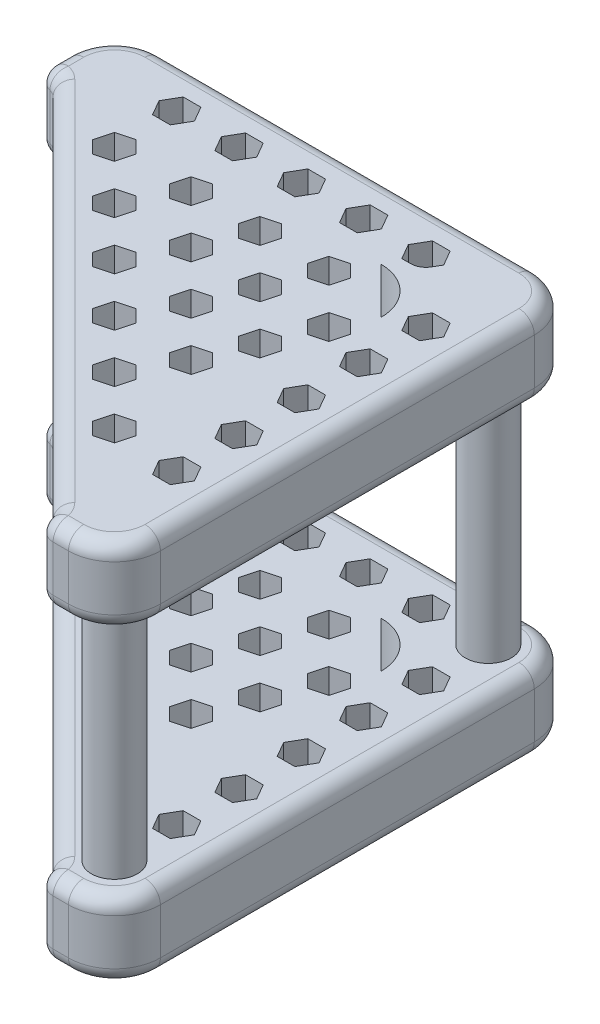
from build123d import *

# Parameters (mm, degrees)
SKETCH1_R           = 1.5
BOSS_EXTRUDE1_DEPTH = 5
SKETCH1_2_R         = 1.5
BOSS_EXTRUDE2_DEPTH = 25
BOSS_EXTRUDE3_START = -5
SKETCH2_R           = 1.5
BOSS_EXTRUDE3_DEPTH = 5
FILLET1_R           = 1


with BuildPart() as part:
    # Sketch1 → Boss-Extrude1 (new body)
    with BuildSketch(Plane(origin=(0, 0, 0), x_dir=(1, 0, 0), z_dir=(0, 1, 0))):
        with BuildLine():
            Line((-9.7, 17.7), (14.7, 17.7))
            ThreePointArc((14.7, 17.7), (16.821320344, 16.821320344), (17.7, 14.7))
            Line((17.7, 14.7), (17.7, -9.7))
            ThreePointArc((17.7, -9.7), (16.821320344, -11.821320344), (14.7, -12.7))
            Line((14.7, -12.7), (13.7, -12.7))
            ThreePointArc((13.7, -12.7), (13.08159356, -12.485858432), (12.72804017, -11.935146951))
            ThreePointArc((12.72804017, -11.935146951), (12.628148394, -11.68090928), (12.463187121, -11.463187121))
            Line((12.463187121, -11.463187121), (-11.463187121, 12.463187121))
            ThreePointArc((-11.463187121, 12.463187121), (-11.68090928, 12.628148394), (-11.935146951, 12.72804017))
            ThreePointArc((-11.935146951, 12.72804017), (-12.485858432, 13.08159356), (-12.7, 13.7))
            Line((-12.7, 13.7), (-12.7, 14.7))
            ThreePointArc((-12.7, 14.7), (-11.821320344, 16.821320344), (-9.7, 17.7))
        make_face()
        with Locations(Location((-9.7, 14.7, 0), (0, 0, 270))):
            Circle(SKETCH1_R, mode=Mode.SUBTRACT)
        with Locations(Location((14.7, -9.7, 0), (0, 0, 270))):
            Circle(SKETCH1_R, mode=Mode.SUBTRACT)
        with Locations(Location((14.7, 14.7, 0), (0, 0, 270))):
            Circle(SKETCH1_R, mode=Mode.SUBTRACT)
        Polygon((-4.478632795, 14.7), (-5.055983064, 15.7), (-6.210683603, 15.7), (-6.788033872, 14.7), (-6.210683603, 13.7), (-5.055983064, 13.7), align=None, mode=Mode.SUBTRACT)
        Polygon((-0.411966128, 14.7), (-0.989316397, 15.7), (-2.144016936, 15.7), (-2.721367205, 14.7), (-2.144016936, 13.7), (-0.989316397, 13.7), align=None, mode=Mode.SUBTRACT)
        Polygon((3.654700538, 14.7), (3.077350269, 15.7), (1.922649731, 15.7), (1.345299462, 14.7), (1.922649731, 13.7), (3.077350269, 13.7), align=None, mode=Mode.SUBTRACT)
        Polygon((7.721367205, 14.7), (7.144016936, 15.7), (5.989316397, 15.7), (5.411966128, 14.7), (5.989316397, 13.7), (7.144016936, 13.7), align=None, mode=Mode.SUBTRACT)
        Polygon((11.788033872, 14.7), (11.210683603, 15.7), (10.055983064, 15.7), (9.478632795, 14.7), (10.055983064, 13.7), (11.210683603, 13.7), align=None, mode=Mode.SUBTRACT)
        Polygon((15.854700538, 10.633333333), (15.277350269, 11.633333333), (14.122649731, 11.633333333), (13.545299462, 10.633333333), (14.122649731, 9.633333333), (15.277350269, 9.633333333), align=None, mode=Mode.SUBTRACT)
        Polygon((15.854700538, 6.566666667), (15.277350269, 7.566666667), (14.122649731, 7.566666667), (13.545299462, 6.566666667), (14.122649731, 5.566666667), (15.277350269, 5.566666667), align=None, mode=Mode.SUBTRACT)
        Polygon((15.854700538, 2.5), (15.277350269, 3.5), (14.122649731, 3.5), (13.545299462, 2.5), (14.122649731, 1.5), (15.277350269, 1.5), align=None, mode=Mode.SUBTRACT)
        Polygon((15.854700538, -1.566666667), (15.277350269, -0.566666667), (14.122649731, -0.566666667), (13.545299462, -1.566666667), (14.122649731, -2.566666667), (15.277350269, -2.566666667), align=None, mode=Mode.SUBTRACT)
        Polygon((15.854700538, -5.633333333), (15.277350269, -4.633333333), (14.122649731, -4.633333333), (13.545299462, -5.633333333), (14.122649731, -6.633333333), (15.277350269, -6.633333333), align=None, mode=Mode.SUBTRACT)
        with BuildLine():
            Line((9.7, 12.7), (12.7, 9.7))
            ThreePointArc((12.7, 9.7), (11.821320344, 11.821320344), (9.7, 12.7))
        make_face(mode=Mode.SUBTRACT)
        Polygon((-1.634856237, 6.634856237), (-1.335997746, 7.750211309), (-2.152494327, 8.56670789), (-3.267849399, 8.267849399), (-3.56670789, 7.152494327), (-2.750211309, 6.335997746), align=None, mode=Mode.SUBTRACT)
        Polygon((-4.816836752, 9.816836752), (-4.517978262, 10.932191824), (-5.334474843, 11.748688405), (-6.449829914, 11.449829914), (-6.748688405, 10.334474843), (-5.932191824, 9.517978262), align=None, mode=Mode.SUBTRACT)
        Polygon((1.547124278, 3.452875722), (1.845982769, 4.568230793), (1.029486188, 5.384727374), (-0.085868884, 5.085868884), (-0.384727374, 3.970513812), (0.431769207, 3.154017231), align=None, mode=Mode.SUBTRACT)
        Polygon((4.729104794, 0.270895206), (5.027963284, 1.386250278), (4.211466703, 2.202746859), (3.096111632, 1.903888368), (2.797253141, 0.788533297), (3.613749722, -0.027963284), align=None, mode=Mode.SUBTRACT)
        Polygon((7.911085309, -2.911085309), (8.2099438, -1.795730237), (7.393447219, -0.979233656), (6.278092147, -1.278092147), (5.979233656, -2.393447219), (6.795730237, -3.2099438), align=None, mode=Mode.SUBTRACT)
        Polygon((11.093065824, -6.093065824), (11.391924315, -4.977710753), (10.575427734, -4.161214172), (9.460072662, -4.460072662), (9.161214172, -5.575427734), (9.977710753, -6.391924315), align=None, mode=Mode.SUBTRACT)
        Polygon((0.183163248, 9.816836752), (0.482021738, 10.932191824), (-0.334474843, 11.748688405), (-1.449829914, 11.449829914), (-1.748688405, 10.334474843), (-0.932191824, 9.517978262), align=None, mode=Mode.SUBTRACT)
        Polygon((3.365143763, 6.634856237), (3.664002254, 7.750211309), (2.847505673, 8.56670789), (1.732150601, 8.267849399), (1.43329211, 7.152494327), (2.249788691, 6.335997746), align=None, mode=Mode.SUBTRACT)
        Polygon((6.547124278, 3.452875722), (6.845982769, 4.568230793), (6.029486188, 5.384727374), (4.914131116, 5.085868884), (4.615272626, 3.970513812), (5.431769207, 3.154017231), align=None, mode=Mode.SUBTRACT)
        Polygon((9.729104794, 0.270895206), (10.027963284, 1.386250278), (9.211466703, 2.202746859), (8.096111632, 1.903888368), (7.797253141, 0.788533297), (8.613749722, -0.027963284), align=None, mode=Mode.SUBTRACT)
        Polygon((4.683163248, 9.816836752), (4.982021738, 10.932191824), (4.165525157, 11.748688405), (3.050170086, 11.449829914), (2.751311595, 10.334474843), (3.567808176, 9.517978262), align=None, mode=Mode.SUBTRACT)
        Polygon((7.865143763, 6.634856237), (8.164002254, 7.750211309), (7.347505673, 8.56670789), (6.232150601, 8.267849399), (5.93329211, 7.152494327), (6.749788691, 6.335997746), align=None, mode=Mode.SUBTRACT)
        Polygon((11.047124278, 3.452875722), (11.345982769, 4.568230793), (10.529486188, 5.384727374), (9.414131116, 5.085868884), (9.115272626, 3.970513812), (9.931769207, 3.154017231), align=None, mode=Mode.SUBTRACT)
        Polygon((9.183163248, 9.816836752), (9.482021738, 10.932191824), (8.665525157, 11.748688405), (7.550170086, 11.449829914), (7.251311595, 10.334474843), (8.067808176, 9.517978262), align=None, mode=Mode.SUBTRACT)
        Polygon((12.365143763, 6.634856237), (12.664002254, 7.750211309), (11.847505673, 8.56670789), (10.732150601, 8.267849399), (10.43329211, 7.152494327), (11.249788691, 6.335997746), align=None, mode=Mode.SUBTRACT)
    extrude(amount=BOSS_EXTRUDE1_DEPTH)

    # Sketch1_2 → Boss-Extrude2 (add)
    with BuildSketch(Plane(origin=(0, 0, 0), x_dir=(1, 0, 0), z_dir=(0, 1, 0))):
        with Locations(Location((14.7, 14.7, 0), (0, 0, 270))):
            Circle(SKETCH1_2_R)
        with Locations(Location((-9.7, 14.7, 0), (0, 0, 270))):
            Circle(SKETCH1_2_R)
        with Locations(Location((14.7, -9.7, 0), (0, 0, 270))):
            Circle(SKETCH1_2_R)
    extrude(amount=BOSS_EXTRUDE2_DEPTH)

    # Sketch2 → Boss-Extrude3 (add)
    with BuildSketch(Plane(origin=(0, 25, 0), x_dir=(1, 0, 0), z_dir=(0, 1, 0)).offset(BOSS_EXTRUDE3_START)):
        with BuildLine():
            Line((-9.7, 17.7), (14.7, 17.7))
            ThreePointArc((14.7, 17.7), (16.821320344, 16.821320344), (17.7, 14.7))
            Line((17.7, 14.7), (17.7, -9.7))
            ThreePointArc((17.7, -9.7), (16.821320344, -11.821320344), (14.7, -12.7))
            Line((14.7, -12.7), (13.7, -12.7))
            ThreePointArc((13.7, -12.7), (13.08159356, -12.485858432), (12.72804017, -11.935146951))
            ThreePointArc((12.72804017, -11.935146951), (12.628148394, -11.68090928), (12.463187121, -11.463187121))
            Line((12.463187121, -11.463187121), (-11.463187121, 12.463187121))
            ThreePointArc((-11.463187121, 12.463187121), (-11.68090928, 12.628148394), (-11.935146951, 12.72804017))
            ThreePointArc((-11.935146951, 12.72804017), (-12.485858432, 13.08159356), (-12.7, 13.7))
            Line((-12.7, 13.7), (-12.7, 14.7))
            ThreePointArc((-12.7, 14.7), (-11.821320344, 16.821320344), (-9.7, 17.7))
        make_face()
        with Locations(Location((-9.7, 14.7, 0), (0, 0, 270))):
            Circle(SKETCH2_R, mode=Mode.SUBTRACT)
        with Locations(Location((14.7, -9.7, 0), (0, 0, 270))):
            Circle(SKETCH2_R, mode=Mode.SUBTRACT)
        with Locations(Location((14.7, 14.7, 0), (0, 0, 270))):
            Circle(SKETCH2_R, mode=Mode.SUBTRACT)
        Polygon((-4.478632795, 14.7), (-5.055983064, 15.7), (-6.210683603, 15.7), (-6.788033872, 14.7), (-6.210683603, 13.7), (-5.055983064, 13.7), align=None, mode=Mode.SUBTRACT)
        Polygon((-0.411966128, 14.7), (-0.989316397, 15.7), (-2.144016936, 15.7), (-2.721367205, 14.7), (-2.144016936, 13.7), (-0.989316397, 13.7), align=None, mode=Mode.SUBTRACT)
        Polygon((3.654700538, 14.7), (3.077350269, 15.7), (1.922649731, 15.7), (1.345299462, 14.7), (1.922649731, 13.7), (3.077350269, 13.7), align=None, mode=Mode.SUBTRACT)
        Polygon((7.721367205, 14.7), (7.144016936, 15.7), (5.989316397, 15.7), (5.411966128, 14.7), (5.989316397, 13.7), (7.144016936, 13.7), align=None, mode=Mode.SUBTRACT)
        Polygon((11.788033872, 14.7), (11.210683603, 15.7), (10.055983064, 15.7), (9.478632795, 14.7), (10.055983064, 13.7), (11.210683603, 13.7), align=None, mode=Mode.SUBTRACT)
        Polygon((15.854700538, 10.633333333), (15.277350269, 11.633333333), (14.122649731, 11.633333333), (13.545299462, 10.633333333), (14.122649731, 9.633333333), (15.277350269, 9.633333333), align=None, mode=Mode.SUBTRACT)
        Polygon((15.854700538, 6.566666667), (15.277350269, 7.566666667), (14.122649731, 7.566666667), (13.545299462, 6.566666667), (14.122649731, 5.566666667), (15.277350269, 5.566666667), align=None, mode=Mode.SUBTRACT)
        Polygon((15.854700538, 2.5), (15.277350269, 3.5), (14.122649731, 3.5), (13.545299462, 2.5), (14.122649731, 1.5), (15.277350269, 1.5), align=None, mode=Mode.SUBTRACT)
        Polygon((15.854700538, -1.566666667), (15.277350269, -0.566666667), (14.122649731, -0.566666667), (13.545299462, -1.566666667), (14.122649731, -2.566666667), (15.277350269, -2.566666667), align=None, mode=Mode.SUBTRACT)
        Polygon((15.854700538, -5.633333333), (15.277350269, -4.633333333), (14.122649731, -4.633333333), (13.545299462, -5.633333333), (14.122649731, -6.633333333), (15.277350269, -6.633333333), align=None, mode=Mode.SUBTRACT)
        with BuildLine():
            Line((9.7, 12.7), (12.7, 9.7))
            ThreePointArc((12.7, 9.7), (11.821320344, 11.821320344), (9.7, 12.7))
        make_face(mode=Mode.SUBTRACT)
        Polygon((-1.634856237, 6.634856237), (-1.335997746, 7.750211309), (-2.152494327, 8.56670789), (-3.267849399, 8.267849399), (-3.56670789, 7.152494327), (-2.750211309, 6.335997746), align=None, mode=Mode.SUBTRACT)
        Polygon((-4.816836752, 9.816836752), (-4.517978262, 10.932191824), (-5.334474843, 11.748688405), (-6.449829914, 11.449829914), (-6.748688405, 10.334474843), (-5.932191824, 9.517978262), align=None, mode=Mode.SUBTRACT)
        Polygon((1.547124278, 3.452875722), (1.845982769, 4.568230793), (1.029486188, 5.384727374), (-0.085868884, 5.085868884), (-0.384727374, 3.970513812), (0.431769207, 3.154017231), align=None, mode=Mode.SUBTRACT)
        Polygon((4.729104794, 0.270895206), (5.027963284, 1.386250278), (4.211466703, 2.202746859), (3.096111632, 1.903888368), (2.797253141, 0.788533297), (3.613749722, -0.027963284), align=None, mode=Mode.SUBTRACT)
        Polygon((7.911085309, -2.911085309), (8.2099438, -1.795730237), (7.393447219, -0.979233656), (6.278092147, -1.278092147), (5.979233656, -2.393447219), (6.795730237, -3.2099438), align=None, mode=Mode.SUBTRACT)
        Polygon((11.093065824, -6.093065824), (11.391924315, -4.977710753), (10.575427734, -4.161214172), (9.460072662, -4.460072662), (9.161214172, -5.575427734), (9.977710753, -6.391924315), align=None, mode=Mode.SUBTRACT)
        Polygon((0.183163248, 9.816836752), (0.482021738, 10.932191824), (-0.334474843, 11.748688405), (-1.449829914, 11.449829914), (-1.748688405, 10.334474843), (-0.932191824, 9.517978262), align=None, mode=Mode.SUBTRACT)
        Polygon((3.365143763, 6.634856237), (3.664002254, 7.750211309), (2.847505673, 8.56670789), (1.732150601, 8.267849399), (1.43329211, 7.152494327), (2.249788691, 6.335997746), align=None, mode=Mode.SUBTRACT)
        Polygon((6.547124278, 3.452875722), (6.845982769, 4.568230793), (6.029486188, 5.384727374), (4.914131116, 5.085868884), (4.615272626, 3.970513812), (5.431769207, 3.154017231), align=None, mode=Mode.SUBTRACT)
        Polygon((9.729104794, 0.270895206), (10.027963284, 1.386250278), (9.211466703, 2.202746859), (8.096111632, 1.903888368), (7.797253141, 0.788533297), (8.613749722, -0.027963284), align=None, mode=Mode.SUBTRACT)
        Polygon((4.683163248, 9.816836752), (4.982021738, 10.932191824), (4.165525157, 11.748688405), (3.050170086, 11.449829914), (2.751311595, 10.334474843), (3.567808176, 9.517978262), align=None, mode=Mode.SUBTRACT)
        Polygon((7.865143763, 6.634856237), (8.164002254, 7.750211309), (7.347505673, 8.56670789), (6.232150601, 8.267849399), (5.93329211, 7.152494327), (6.749788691, 6.335997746), align=None, mode=Mode.SUBTRACT)
        Polygon((11.047124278, 3.452875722), (11.345982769, 4.568230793), (10.529486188, 5.384727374), (9.414131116, 5.085868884), (9.115272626, 3.970513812), (9.931769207, 3.154017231), align=None, mode=Mode.SUBTRACT)
        Polygon((9.183163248, 9.816836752), (9.482021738, 10.932191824), (8.665525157, 11.748688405), (7.550170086, 11.449829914), (7.251311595, 10.334474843), (8.067808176, 9.517978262), align=None, mode=Mode.SUBTRACT)
        Polygon((12.365143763, 6.634856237), (12.664002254, 7.750211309), (11.847505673, 8.56670789), (10.732150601, 8.267849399), (10.43329211, 7.152494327), (11.249788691, 6.335997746), align=None, mode=Mode.SUBTRACT)
    extrude(amount=BOSS_EXTRUDE3_DEPTH)

    # Fillet1
    fillet1_edges = [part.edges().sort_by_distance(p)[0] for p in [
        (0.5, 0, -0.5),
        (-11.68090928, 0, -12.628148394),
        (14.2, 5, 12.7),
        (-12.485858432, 0, -13.08159356),
        (-12.7, 0, -14.2),
        (-11.821320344, 0, -16.821320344),
        (2.5, 0, -17.7),
        (16.821320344, 0, -16.821320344),
        (17.7, 0, -2.5),
        (16.821320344, 0, 11.821320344),
        (14.2, 0, 12.7),
        (13.08159356, 0, 12.485858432),
        (12.628148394, 0, 11.68090928),
        (16.821320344, 5, 11.821320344),
        (17.7, 5, -2.5),
        (16.821320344, 5, -16.821320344),
        (2.5, 5, -17.7),
        (-11.821320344, 5, -16.821320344),
        (-12.7, 5, -14.2),
        (-12.485858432, 5, -13.08159356),
        (-11.68090928, 5, -12.628148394),
        (0.5, 5, -0.5),
        (12.628148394, 5, 11.68090928),
        (12.628148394, 20, 11.68090928),
        (0.5, 20, -0.5),
        (-11.68090928, 20, -12.628148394),
        (-12.485858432, 20, -13.08159356),
        (-12.7, 20, -14.2),
        (-11.821320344, 20, -16.821320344),
        (2.5, 20, -17.7),
        (16.821320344, 20, -16.821320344),
        (17.7, 20, -2.5),
        (16.821320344, 20, 11.821320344),
        (14.2, 20, 12.7),
        (13.08159356, 20, 12.485858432),
        (12.628148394, 25, 11.68090928),
        (13.08159356, 25, 12.485858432),
        (14.2, 25, 12.7),
        (16.821320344, 25, 11.821320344),
        (17.7, 25, -2.5),
        (16.821320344, 25, -16.821320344),
        (2.5, 25, -17.7),
        (-11.821320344, 25, -16.821320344),
        (-12.7, 25, -14.2),
        (-12.485858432, 25, -13.08159356),
        (-11.68090928, 25, -12.628148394),
        (0.5, 25, -0.5),
        (11.210683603, 22.5, -13.7),
        (13.08159356, 5, 12.485858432),
    ]]
    fillet(fillet1_edges, radius=FILLET1_R)


solid = part.part
